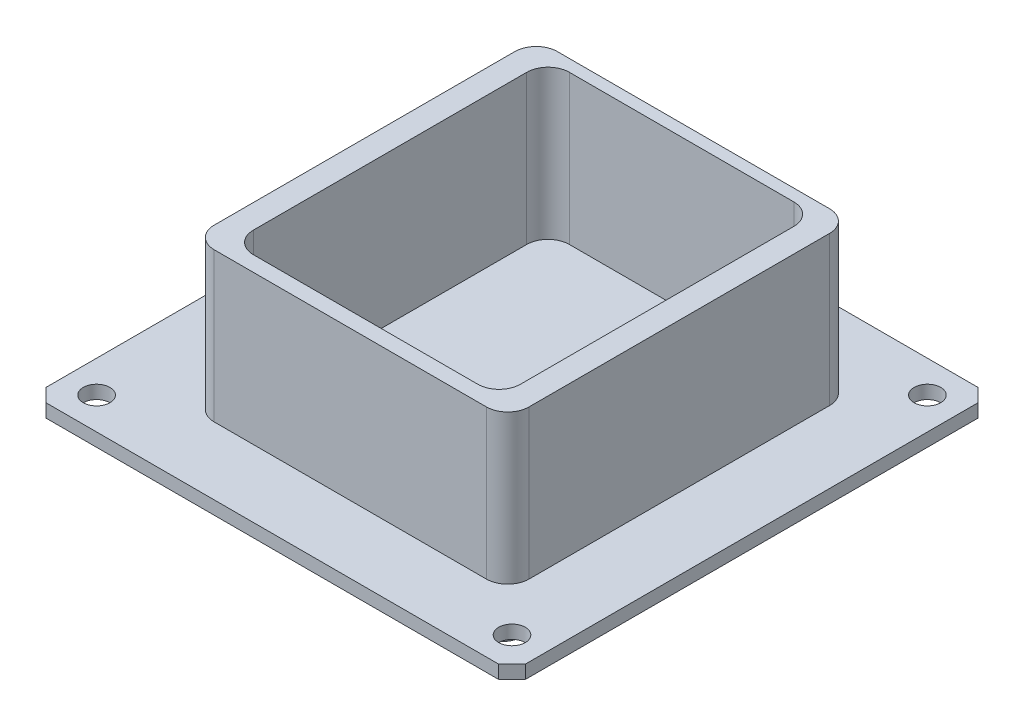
ISO-10303-21;
HEADER;
FILE_DESCRIPTION(('STEP AP214'),'2;1');
FILE_NAME('part.step','',(''),(''),'','','');
FILE_SCHEMA(('AUTOMOTIVE_DESIGN { 1 0 10303 214 1 1 1 1 }'));
ENDSEC;
DATA;
#1=APPLICATION_CONTEXT('core data for automotive mechanical design processes');
#2=APPLICATION_PROTOCOL_DEFINITION('international standard','automotive_design',2000,#1);
#3=PRODUCT_CONTEXT('',#1,'mechanical');
#4=PRODUCT('Part','Part','',(#3));
#5=PRODUCT_RELATED_PRODUCT_CATEGORY('part','',(#4));
#6=PRODUCT_DEFINITION_FORMATION('','',#4);
#7=PRODUCT_DEFINITION_CONTEXT('part definition',#1,'design');
#8=PRODUCT_DEFINITION('design','',#6,#7);
#9=PRODUCT_DEFINITION_SHAPE('','',#8);
#10=(LENGTH_UNIT() NAMED_UNIT(*) SI_UNIT(.MILLI.,.METRE.));
#11=(NAMED_UNIT(*) PLANE_ANGLE_UNIT() SI_UNIT($,.RADIAN.));
#12=(NAMED_UNIT(*) SI_UNIT($,.STERADIAN.) SOLID_ANGLE_UNIT());
#13=UNCERTAINTY_MEASURE_WITH_UNIT(LENGTH_MEASURE(1.E-05),#10,'distance_accuracy_value','');
#14=(GEOMETRIC_REPRESENTATION_CONTEXT(3) GLOBAL_UNCERTAINTY_ASSIGNED_CONTEXT((#13)) GLOBAL_UNIT_ASSIGNED_CONTEXT((#10,
#11,#12)) REPRESENTATION_CONTEXT('',''));
#15=CARTESIAN_POINT('',(0.,0.,0.));
#16=DIRECTION('',(0.,0.,1.));
#17=DIRECTION('',(1.,0.,0.));
#18=AXIS2_PLACEMENT_3D('',#15,#16,#17);
#19=CARTESIAN_POINT('',(84.1375,0.,-28.575));
#20=DIRECTION('',(0.,1.,0.));
#21=DIRECTION('',(0.,0.,1.));
#22=AXIS2_PLACEMENT_3D('',#19,#20,#21);
#23=PLANE('',#22);
#24=CARTESIAN_POINT('',(3.81,0.,-3.81));
#25=DIRECTION('',(0.,1.,0.));
#26=DIRECTION('',(0.,0.,-1.));
#27=AXIS2_PLACEMENT_3D('',#24,#25,#26);
#28=CIRCLE('',#27,1.5875);
#29=CARTESIAN_POINT('',(3.81,0.,-5.3975));
#30=VERTEX_POINT('',#29);
#31=EDGE_CURVE('E405',#30,#30,#28,.T.);
#32=ORIENTED_EDGE('',*,*,#31,.T.);
#33=EDGE_LOOP('',(#32));
#34=FACE_BOUND('',#33,.T.);
#35=CARTESIAN_POINT('',(53.34,0.,-53.34));
#36=DIRECTION('',(0.,1.,0.));
#37=DIRECTION('',(0.,0.,-1.));
#38=AXIS2_PLACEMENT_3D('',#35,#36,#37);
#39=CIRCLE('',#38,1.5875);
#40=CARTESIAN_POINT('',(53.34,0.,-54.9275));
#41=VERTEX_POINT('',#40);
#42=EDGE_CURVE('E422',#41,#41,#39,.T.);
#43=ORIENTED_EDGE('',*,*,#42,.T.);
#44=EDGE_LOOP('',(#43));
#45=FACE_BOUND('',#44,.T.);
#46=DIRECTION('',(-0.707106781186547,0.,-0.707106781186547));
#47=VECTOR('',#46,1.);
#48=CARTESIAN_POINT('',(55.5625,0.,-57.15));
#49=LINE('',#48,#47);
#50=CARTESIAN_POINT('',(57.15,0.,-55.5625));
#51=VERTEX_POINT('',#50);
#52=CARTESIAN_POINT('',(55.5625,0.,-57.15));
#53=VERTEX_POINT('',#52);
#54=EDGE_CURVE('E264',#51,#53,#49,.T.);
#55=ORIENTED_EDGE('',*,*,#54,.F.);
#56=DIRECTION('',(0.,0.,-1.));
#57=VECTOR('',#56,1.);
#58=CARTESIAN_POINT('',(57.15,0.,-1.5875));
#59=LINE('',#58,#57);
#60=CARTESIAN_POINT('',(57.15,0.,-1.5875));
#61=VERTEX_POINT('',#60);
#62=EDGE_CURVE('E260',#61,#51,#59,.T.);
#63=ORIENTED_EDGE('',*,*,#62,.F.);
#64=DIRECTION('',(0.707106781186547,0.,-0.707106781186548));
#65=VECTOR('',#64,1.);
#66=CARTESIAN_POINT('',(55.5625,0.,0.));
#67=LINE('',#66,#65);
#68=CARTESIAN_POINT('',(55.5625,0.,0.));
#69=VERTEX_POINT('',#68);
#70=EDGE_CURVE('E458',#69,#61,#67,.T.);
#71=ORIENTED_EDGE('',*,*,#70,.F.);
#72=DIRECTION('',(1.,0.,0.));
#73=VECTOR('',#72,1.);
#74=CARTESIAN_POINT('',(1.5875,0.,0.));
#75=LINE('',#74,#73);
#76=CARTESIAN_POINT('',(1.5875,0.,0.));
#77=VERTEX_POINT('',#76);
#78=EDGE_CURVE('E456',#77,#69,#75,.T.);
#79=ORIENTED_EDGE('',*,*,#78,.F.);
#80=DIRECTION('',(0.707106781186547,0.,0.707106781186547));
#81=VECTOR('',#80,1.);
#82=CARTESIAN_POINT('',(0.,0.,-1.5875));
#83=LINE('',#82,#81);
#84=CARTESIAN_POINT('',(0.,0.,-1.5875));
#85=VERTEX_POINT('',#84);
#86=EDGE_CURVE('E454',#85,#77,#83,.T.);
#87=ORIENTED_EDGE('',*,*,#86,.F.);
#88=DIRECTION('',(0.,0.,1.));
#89=VECTOR('',#88,1.);
#90=CARTESIAN_POINT('',(0.,0.,-1.5875));
#91=LINE('',#90,#89);
#92=CARTESIAN_POINT('',(0.,0.,-55.5625));
#93=VERTEX_POINT('',#92);
#94=EDGE_CURVE('E452',#93,#85,#91,.T.);
#95=ORIENTED_EDGE('',*,*,#94,.F.);
#96=DIRECTION('',(-0.707106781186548,0.,0.707106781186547));
#97=VECTOR('',#96,1.);
#98=CARTESIAN_POINT('',(0.,0.,-55.5625));
#99=LINE('',#98,#97);
#100=CARTESIAN_POINT('',(1.5875,0.,-57.15));
#101=VERTEX_POINT('',#100);
#102=EDGE_CURVE('E450',#101,#93,#99,.T.);
#103=ORIENTED_EDGE('',*,*,#102,.F.);
#104=DIRECTION('',(-1.,0.,0.));
#105=VECTOR('',#104,1.);
#106=CARTESIAN_POINT('',(1.5875,0.,-57.15));
#107=LINE('',#106,#105);
#108=EDGE_CURVE('E448',#53,#101,#107,.T.);
#109=ORIENTED_EDGE('',*,*,#108,.F.);
#110=EDGE_LOOP('',(#55,#63,#71,#79,#87,#95,#103,#109));
#111=FACE_BOUND('',#110,.T.);
#112=CARTESIAN_POINT('',(53.34,0.,-3.81));
#113=DIRECTION('',(0.,1.,0.));
#114=DIRECTION('',(0.,0.,1.));
#115=AXIS2_PLACEMENT_3D('',#112,#113,#114);
#116=CIRCLE('',#115,1.5875);
#117=CARTESIAN_POINT('',(53.34,0.,-2.2225));
#118=VERTEX_POINT('',#117);
#119=EDGE_CURVE('E428',#118,#118,#116,.T.);
#120=ORIENTED_EDGE('',*,*,#119,.T.);
#121=EDGE_LOOP('',(#120));
#122=FACE_BOUND('',#121,.T.);
#123=CARTESIAN_POINT('',(3.81,0.,-53.34));
#124=DIRECTION('',(0.,1.,0.));
#125=DIRECTION('',(0.,0.,1.));
#126=AXIS2_PLACEMENT_3D('',#123,#124,#125);
#127=CIRCLE('',#126,1.5875);
#128=CARTESIAN_POINT('',(3.81,0.,-51.7525));
#129=VERTEX_POINT('',#128);
#130=EDGE_CURVE('E416',#129,#129,#127,.T.);
#131=ORIENTED_EDGE('',*,*,#130,.T.);
#132=EDGE_LOOP('',(#131));
#133=FACE_BOUND('',#132,.T.);
#134=DIRECTION('',(0.,0.,-1.));
#135=VECTOR('',#134,1.);
#136=CARTESIAN_POINT('',(12.8335904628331,0.,-8.40284011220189));
#137=LINE('',#136,#135);
#138=CARTESIAN_POINT('',(12.8335904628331,0.,-10.9428401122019));
#139=VERTEX_POINT('',#138);
#140=CARTESIAN_POINT('',(12.8335904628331,0.,-47.8993057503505));
#141=VERTEX_POINT('',#140);
#142=EDGE_CURVE('E929',#139,#141,#137,.T.);
#143=ORIENTED_EDGE('',*,*,#142,.F.);
#144=CARTESIAN_POINT('',(15.3735904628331,0.,-10.9428401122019));
#145=DIRECTION('',(0.,1.,0.));
#146=DIRECTION('',(0.,0.,1.));
#147=AXIS2_PLACEMENT_3D('',#144,#145,#146);
#148=CIRCLE('',#147,2.54);
#149=CARTESIAN_POINT('',(15.3735904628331,0.,-8.40284011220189));
#150=VERTEX_POINT('',#149);
#151=EDGE_CURVE('E355',#139,#150,#148,.T.);
#152=ORIENTED_EDGE('',*,*,#151,.T.);
#153=DIRECTION('',(-1.,0.,0.));
#154=VECTOR('',#153,1.);
#155=CARTESIAN_POINT('',(12.8335904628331,0.,-8.40284011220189));
#156=LINE('',#155,#154);
#157=CARTESIAN_POINT('',(44.9380504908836,0.,-8.40284011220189));
#158=VERTEX_POINT('',#157);
#159=EDGE_CURVE('E919',#158,#150,#156,.T.);
#160=ORIENTED_EDGE('',*,*,#159,.F.);
#161=CARTESIAN_POINT('',(44.9380504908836,0.,-10.9428401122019));
#162=DIRECTION('',(0.,1.,0.));
#163=DIRECTION('',(0.,0.,1.));
#164=AXIS2_PLACEMENT_3D('',#161,#162,#163);
#165=CIRCLE('',#164,2.54);
#166=CARTESIAN_POINT('',(47.4780504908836,0.,-10.9428401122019));
#167=VERTEX_POINT('',#166);
#168=EDGE_CURVE('E359',#158,#167,#165,.T.);
#169=ORIENTED_EDGE('',*,*,#168,.T.);
#170=DIRECTION('',(0.,0.,1.));
#171=VECTOR('',#170,1.);
#172=CARTESIAN_POINT('',(47.4780504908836,0.,-8.40284011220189));
#173=LINE('',#172,#171);
#174=CARTESIAN_POINT('',(47.4780504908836,0.,-47.8993057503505));
#175=VERTEX_POINT('',#174);
#176=EDGE_CURVE('E923',#175,#167,#173,.T.);
#177=ORIENTED_EDGE('',*,*,#176,.F.);
#178=CARTESIAN_POINT('',(44.9380504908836,0.,-47.8993057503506));
#179=DIRECTION('',(0.,1.,0.));
#180=DIRECTION('',(0.,0.,1.));
#181=AXIS2_PLACEMENT_3D('',#178,#179,#180);
#182=CIRCLE('',#181,2.54);
#183=CARTESIAN_POINT('',(44.9380504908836,0.,-50.4393057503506));
#184=VERTEX_POINT('',#183);
#185=EDGE_CURVE('E357',#175,#184,#182,.T.);
#186=ORIENTED_EDGE('',*,*,#185,.T.);
#187=DIRECTION('',(1.,0.,0.));
#188=VECTOR('',#187,1.);
#189=CARTESIAN_POINT('',(12.8335904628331,0.,-50.4393057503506));
#190=LINE('',#189,#188);
#191=CARTESIAN_POINT('',(15.3735904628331,0.,-50.4393057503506));
#192=VERTEX_POINT('',#191);
#193=EDGE_CURVE('E926',#192,#184,#190,.T.);
#194=ORIENTED_EDGE('',*,*,#193,.F.);
#195=CARTESIAN_POINT('',(15.3735904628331,0.,-47.8993057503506));
#196=DIRECTION('',(0.,1.,0.));
#197=DIRECTION('',(0.,0.,1.));
#198=AXIS2_PLACEMENT_3D('',#195,#196,#197);
#199=CIRCLE('',#198,2.54);
#200=EDGE_CURVE('E353',#192,#141,#199,.T.);
#201=ORIENTED_EDGE('',*,*,#200,.T.);
#202=EDGE_LOOP('',(#143,#152,#160,#169,#177,#186,#194,#201));
#203=FACE_BOUND('',#202,.T.);
#204=ADVANCED_FACE('F30',(#34,#45,#111,#122,#133,#203),#23,.F.);
#205=CARTESIAN_POINT('',(84.1375,1.5875,-28.575));
#206=DIRECTION('',(0.,1.,0.));
#207=DIRECTION('',(0.,0.,1.));
#208=AXIS2_PLACEMENT_3D('',#205,#206,#207);
#209=PLANE('',#208);
#210=CARTESIAN_POINT('',(3.81,1.5875,-53.34));
#211=DIRECTION('',(0.,1.,0.));
#212=DIRECTION('',(0.,0.,1.));
#213=AXIS2_PLACEMENT_3D('',#210,#211,#212);
#214=CIRCLE('',#213,1.5875);
#215=CARTESIAN_POINT('',(3.81,1.5875,-51.7525));
#216=VERTEX_POINT('',#215);
#217=EDGE_CURVE('E419',#216,#216,#214,.T.);
#218=ORIENTED_EDGE('',*,*,#217,.F.);
#219=EDGE_LOOP('',(#218));
#220=FACE_BOUND('',#219,.T.);
#221=CARTESIAN_POINT('',(53.34,1.5875,-3.81));
#222=DIRECTION('',(0.,1.,0.));
#223=DIRECTION('',(0.,0.,1.));
#224=AXIS2_PLACEMENT_3D('',#221,#222,#223);
#225=CIRCLE('',#224,1.5875);
#226=CARTESIAN_POINT('',(53.34,1.5875,-2.2225));
#227=VERTEX_POINT('',#226);
#228=EDGE_CURVE('E431',#227,#227,#225,.T.);
#229=ORIENTED_EDGE('',*,*,#228,.F.);
#230=EDGE_LOOP('',(#229));
#231=FACE_BOUND('',#230,.T.);
#232=DIRECTION('',(-0.707106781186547,0.,-0.707106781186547));
#233=VECTOR('',#232,1.);
#234=CARTESIAN_POINT('',(55.5625,1.5875,-57.15));
#235=LINE('',#234,#233);
#236=CARTESIAN_POINT('',(57.15,1.5875,-55.5625));
#237=VERTEX_POINT('',#236);
#238=CARTESIAN_POINT('',(55.5625,1.5875,-57.15));
#239=VERTEX_POINT('',#238);
#240=EDGE_CURVE('E250',#237,#239,#235,.T.);
#241=ORIENTED_EDGE('',*,*,#240,.T.);
#242=DIRECTION('',(-1.,0.,0.));
#243=VECTOR('',#242,1.);
#244=CARTESIAN_POINT('',(1.5875,1.5875,-57.15));
#245=LINE('',#244,#243);
#246=CARTESIAN_POINT('',(1.5875,1.5875,-57.15));
#247=VERTEX_POINT('',#246);
#248=EDGE_CURVE('E239',#239,#247,#245,.T.);
#249=ORIENTED_EDGE('',*,*,#248,.T.);
#250=DIRECTION('',(-0.707106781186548,0.,0.707106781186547));
#251=VECTOR('',#250,1.);
#252=CARTESIAN_POINT('',(0.,1.5875,-55.5625));
#253=LINE('',#252,#251);
#254=CARTESIAN_POINT('',(0.,1.5875,-55.5625));
#255=VERTEX_POINT('',#254);
#256=EDGE_CURVE('E249',#247,#255,#253,.T.);
#257=ORIENTED_EDGE('',*,*,#256,.T.);
#258=DIRECTION('',(0.,0.,1.));
#259=VECTOR('',#258,1.);
#260=CARTESIAN_POINT('',(0.,1.5875,-1.5875));
#261=LINE('',#260,#259);
#262=CARTESIAN_POINT('',(0.,1.5875,-1.5875));
#263=VERTEX_POINT('',#262);
#264=EDGE_CURVE('E437',#255,#263,#261,.T.);
#265=ORIENTED_EDGE('',*,*,#264,.T.);
#266=DIRECTION('',(0.707106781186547,0.,0.707106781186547));
#267=VECTOR('',#266,1.);
#268=CARTESIAN_POINT('',(0.,1.5875,-1.5875));
#269=LINE('',#268,#267);
#270=CARTESIAN_POINT('',(1.5875,1.5875,0.));
#271=VERTEX_POINT('',#270);
#272=EDGE_CURVE('E439',#263,#271,#269,.T.);
#273=ORIENTED_EDGE('',*,*,#272,.T.);
#274=DIRECTION('',(1.,0.,0.));
#275=VECTOR('',#274,1.);
#276=CARTESIAN_POINT('',(1.5875,1.5875,0.));
#277=LINE('',#276,#275);
#278=CARTESIAN_POINT('',(55.5625,1.5875,0.));
#279=VERTEX_POINT('',#278);
#280=EDGE_CURVE('E441',#271,#279,#277,.T.);
#281=ORIENTED_EDGE('',*,*,#280,.T.);
#282=DIRECTION('',(0.707106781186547,0.,-0.707106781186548));
#283=VECTOR('',#282,1.);
#284=CARTESIAN_POINT('',(55.5625,1.5875,0.));
#285=LINE('',#284,#283);
#286=CARTESIAN_POINT('',(57.15,1.5875,-1.5875));
#287=VERTEX_POINT('',#286);
#288=EDGE_CURVE('E443',#279,#287,#285,.T.);
#289=ORIENTED_EDGE('',*,*,#288,.T.);
#290=DIRECTION('',(0.,0.,-1.));
#291=VECTOR('',#290,1.);
#292=CARTESIAN_POINT('',(57.15,1.5875,-1.5875));
#293=LINE('',#292,#291);
#294=EDGE_CURVE('E256',#287,#237,#293,.T.);
#295=ORIENTED_EDGE('',*,*,#294,.T.);
#296=EDGE_LOOP('',(#241,#249,#257,#265,#273,#281,#289,#295));
#297=FACE_BOUND('',#296,.T.);
#298=CARTESIAN_POINT('',(53.34,1.5875,-53.34));
#299=DIRECTION('',(0.,1.,0.));
#300=DIRECTION('',(0.,0.,-1.));
#301=AXIS2_PLACEMENT_3D('',#298,#299,#300);
#302=CIRCLE('',#301,1.5875);
#303=CARTESIAN_POINT('',(53.34,1.5875,-54.9275));
#304=VERTEX_POINT('',#303);
#305=EDGE_CURVE('E425',#304,#304,#302,.T.);
#306=ORIENTED_EDGE('',*,*,#305,.F.);
#307=EDGE_LOOP('',(#306));
#308=FACE_BOUND('',#307,.T.);
#309=CARTESIAN_POINT('',(3.81,1.5875,-3.81));
#310=DIRECTION('',(0.,1.,0.));
#311=DIRECTION('',(0.,0.,-1.));
#312=AXIS2_PLACEMENT_3D('',#309,#310,#311);
#313=CIRCLE('',#312,1.5875);
#314=CARTESIAN_POINT('',(3.81,1.5875,-5.3975));
#315=VERTEX_POINT('',#314);
#316=EDGE_CURVE('E413',#315,#315,#313,.T.);
#317=ORIENTED_EDGE('',*,*,#316,.F.);
#318=EDGE_LOOP('',(#317));
#319=FACE_BOUND('',#318,.T.);
#320=DIRECTION('',(1.,0.,0.));
#321=VECTOR('',#320,1.);
#322=CARTESIAN_POINT('',(11.0523842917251,1.5875,-8.04659887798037));
#323=LINE('',#322,#321);
#324=CARTESIAN_POINT('',(13.5923842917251,1.5875,-8.04659887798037));
#325=VERTEX_POINT('',#324);
#326=CARTESIAN_POINT('',(46.0513043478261,1.5875,-8.04659887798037));
#327=VERTEX_POINT('',#326);
#328=EDGE_CURVE('E374',#325,#327,#323,.T.);
#329=ORIENTED_EDGE('',*,*,#328,.F.);
#330=CARTESIAN_POINT('',(13.5923842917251,1.5875,-10.5865988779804));
#331=DIRECTION('',(0.,1.,0.));
#332=DIRECTION('',(0.,0.,1.));
#333=AXIS2_PLACEMENT_3D('',#330,#331,#332);
#334=CIRCLE('',#333,2.54);
#335=CARTESIAN_POINT('',(11.0523842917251,1.5875,-10.5865988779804));
#336=VERTEX_POINT('',#335);
#337=EDGE_CURVE('E38',#325,#336,#334,.F.);
#338=ORIENTED_EDGE('',*,*,#337,.T.);
#339=DIRECTION('',(0.,0.,1.));
#340=VECTOR('',#339,1.);
#341=CARTESIAN_POINT('',(11.0523842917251,1.5875,-48.9698106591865));
#342=LINE('',#341,#340);
#343=CARTESIAN_POINT('',(11.0523842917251,1.5875,-46.4298106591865));
#344=VERTEX_POINT('',#343);
#345=EDGE_CURVE('E373',#344,#336,#342,.T.);
#346=ORIENTED_EDGE('',*,*,#345,.F.);
#347=CARTESIAN_POINT('',(13.5923842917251,1.5875,-46.4298106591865));
#348=DIRECTION('',(0.,1.,0.));
#349=DIRECTION('',(0.,0.,1.));
#350=AXIS2_PLACEMENT_3D('',#347,#348,#349);
#351=CIRCLE('',#350,2.54);
#352=CARTESIAN_POINT('',(13.5923842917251,1.5875,-48.9698106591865));
#353=VERTEX_POINT('',#352);
#354=EDGE_CURVE('E369',#344,#353,#351,.F.);
#355=ORIENTED_EDGE('',*,*,#354,.T.);
#356=DIRECTION('',(-1.,0.,0.));
#357=VECTOR('',#356,1.);
#358=CARTESIAN_POINT('',(11.0523842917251,1.5875,-48.9698106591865));
#359=LINE('',#358,#357);
#360=CARTESIAN_POINT('',(46.0513043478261,1.5875,-48.9698106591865));
#361=VERTEX_POINT('',#360);
#362=EDGE_CURVE('E400',#361,#353,#359,.T.);
#363=ORIENTED_EDGE('',*,*,#362,.F.);
#364=CARTESIAN_POINT('',(46.0513043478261,1.5875,-46.4298106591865));
#365=DIRECTION('',(0.,1.,0.));
#366=DIRECTION('',(0.,0.,1.));
#367=AXIS2_PLACEMENT_3D('',#364,#365,#366);
#368=CIRCLE('',#367,2.54);
#369=CARTESIAN_POINT('',(48.5913043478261,1.5875,-46.4298106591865));
#370=VERTEX_POINT('',#369);
#371=EDGE_CURVE('E367',#361,#370,#368,.F.);
#372=ORIENTED_EDGE('',*,*,#371,.T.);
#373=DIRECTION('',(0.,0.,-1.));
#374=VECTOR('',#373,1.);
#375=CARTESIAN_POINT('',(48.5913043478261,1.5875,-48.9698106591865));
#376=LINE('',#375,#374);
#377=CARTESIAN_POINT('',(48.5913043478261,1.5875,-10.5865988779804));
#378=VERTEX_POINT('',#377);
#379=EDGE_CURVE('E408',#378,#370,#376,.T.);
#380=ORIENTED_EDGE('',*,*,#379,.F.);
#381=CARTESIAN_POINT('',(46.0513043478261,1.5875,-10.5865988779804));
#382=DIRECTION('',(0.,1.,0.));
#383=DIRECTION('',(0.,0.,1.));
#384=AXIS2_PLACEMENT_3D('',#381,#382,#383);
#385=CIRCLE('',#384,2.54);
#386=EDGE_CURVE('E45',#378,#327,#385,.F.);
#387=ORIENTED_EDGE('',*,*,#386,.T.);
#388=EDGE_LOOP('',(#329,#338,#346,#355,#363,#372,#380,#387));
#389=FACE_BOUND('',#388,.T.);
#390=ADVANCED_FACE('F253',(#220,#231,#297,#308,#319,#389),#209,.T.);
#391=CARTESIAN_POINT('',(55.5625,1.5875,-57.15));
#392=DIRECTION('',(-0.707106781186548,0.,0.707106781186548));
#393=DIRECTION('',(0.707106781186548,0.,0.707106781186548));
#394=AXIS2_PLACEMENT_3D('',#391,#392,#393);
#395=PLANE('',#394);
#396=ORIENTED_EDGE('',*,*,#54,.T.);
#397=DIRECTION('',(0.,-1.,0.));
#398=VECTOR('',#397,1.);
#399=CARTESIAN_POINT('',(55.5625,1.5875,-57.15));
#400=LINE('',#399,#398);
#401=EDGE_CURVE('E243',#239,#53,#400,.T.);
#402=ORIENTED_EDGE('',*,*,#401,.F.);
#403=ORIENTED_EDGE('',*,*,#240,.F.);
#404=DIRECTION('',(0.,-1.,0.));
#405=VECTOR('',#404,1.);
#406=CARTESIAN_POINT('',(57.15,1.5875,-55.5625));
#407=LINE('',#406,#405);
#408=EDGE_CURVE('E446',#237,#51,#407,.T.);
#409=ORIENTED_EDGE('',*,*,#408,.T.);
#410=EDGE_LOOP('',(#396,#402,#403,#409));
#411=FACE_BOUND('',#410,.T.);
#412=ADVANCED_FACE('F262',(#411),#395,.F.);
#413=CARTESIAN_POINT('',(1.5875,1.5875,-57.15));
#414=DIRECTION('',(0.,0.,1.));
#415=DIRECTION('',(1.,0.,0.));
#416=AXIS2_PLACEMENT_3D('',#413,#414,#415);
#417=PLANE('',#416);
#418=ORIENTED_EDGE('',*,*,#108,.T.);
#419=DIRECTION('',(0.,-1.,0.));
#420=VECTOR('',#419,1.);
#421=CARTESIAN_POINT('',(1.5875,1.5875,-57.15));
#422=LINE('',#421,#420);
#423=EDGE_CURVE('E246',#247,#101,#422,.T.);
#424=ORIENTED_EDGE('',*,*,#423,.F.);
#425=ORIENTED_EDGE('',*,*,#248,.F.);
#426=ORIENTED_EDGE('',*,*,#401,.T.);
#427=EDGE_LOOP('',(#418,#424,#425,#426));
#428=FACE_BOUND('',#427,.T.);
#429=ADVANCED_FACE('F241',(#428),#417,.F.);
#430=CARTESIAN_POINT('',(0.,1.5875,-55.5625));
#431=DIRECTION('',(0.707106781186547,0.,0.707106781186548));
#432=DIRECTION('',(0.707106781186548,0.,-0.707106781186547));
#433=AXIS2_PLACEMENT_3D('',#430,#431,#432);
#434=PLANE('',#433);
#435=ORIENTED_EDGE('',*,*,#102,.T.);
#436=DIRECTION('',(0.,-1.,0.));
#437=VECTOR('',#436,1.);
#438=CARTESIAN_POINT('',(0.,1.5875,-55.5625));
#439=LINE('',#438,#437);
#440=EDGE_CURVE('E269',#255,#93,#439,.T.);
#441=ORIENTED_EDGE('',*,*,#440,.F.);
#442=ORIENTED_EDGE('',*,*,#256,.F.);
#443=ORIENTED_EDGE('',*,*,#423,.T.);
#444=EDGE_LOOP('',(#435,#441,#442,#443));
#445=FACE_BOUND('',#444,.T.);
#446=ADVANCED_FACE('F497',(#445),#434,.F.);
#447=CARTESIAN_POINT('',(0.,1.5875,-1.5875));
#448=DIRECTION('',(1.,0.,0.));
#449=DIRECTION('',(0.,0.,-1.));
#450=AXIS2_PLACEMENT_3D('',#447,#448,#449);
#451=PLANE('',#450);
#452=ORIENTED_EDGE('',*,*,#94,.T.);
#453=DIRECTION('',(0.,-1.,0.));
#454=VECTOR('',#453,1.);
#455=CARTESIAN_POINT('',(0.,1.5875,-1.5875));
#456=LINE('',#455,#454);
#457=EDGE_CURVE('E471',#263,#85,#456,.T.);
#458=ORIENTED_EDGE('',*,*,#457,.F.);
#459=ORIENTED_EDGE('',*,*,#264,.F.);
#460=ORIENTED_EDGE('',*,*,#440,.T.);
#461=EDGE_LOOP('',(#452,#458,#459,#460));
#462=FACE_BOUND('',#461,.T.);
#463=ADVANCED_FACE('F478',(#462),#451,.F.);
#464=CARTESIAN_POINT('',(0.,1.5875,-1.5875));
#465=DIRECTION('',(0.707106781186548,0.,-0.707106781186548));
#466=DIRECTION('',(-0.707106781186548,0.,-0.707106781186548));
#467=AXIS2_PLACEMENT_3D('',#464,#465,#466);
#468=PLANE('',#467);
#469=ORIENTED_EDGE('',*,*,#86,.T.);
#470=DIRECTION('',(0.,-1.,0.));
#471=VECTOR('',#470,1.);
#472=CARTESIAN_POINT('',(1.5875,1.5875,0.));
#473=LINE('',#472,#471);
#474=EDGE_CURVE('E468',#271,#77,#473,.T.);
#475=ORIENTED_EDGE('',*,*,#474,.F.);
#476=ORIENTED_EDGE('',*,*,#272,.F.);
#477=ORIENTED_EDGE('',*,*,#457,.T.);
#478=EDGE_LOOP('',(#469,#475,#476,#477));
#479=FACE_BOUND('',#478,.T.);
#480=ADVANCED_FACE('F489',(#479),#468,.F.);
#481=CARTESIAN_POINT('',(1.5875,1.5875,0.));
#482=DIRECTION('',(0.,0.,-1.));
#483=DIRECTION('',(-1.,0.,0.));
#484=AXIS2_PLACEMENT_3D('',#481,#482,#483);
#485=PLANE('',#484);
#486=ORIENTED_EDGE('',*,*,#78,.T.);
#487=DIRECTION('',(0.,-1.,0.));
#488=VECTOR('',#487,1.);
#489=CARTESIAN_POINT('',(55.5625,1.5875,0.));
#490=LINE('',#489,#488);
#491=EDGE_CURVE('E465',#279,#69,#490,.T.);
#492=ORIENTED_EDGE('',*,*,#491,.F.);
#493=ORIENTED_EDGE('',*,*,#280,.F.);
#494=ORIENTED_EDGE('',*,*,#474,.T.);
#495=EDGE_LOOP('',(#486,#492,#493,#494));
#496=FACE_BOUND('',#495,.T.);
#497=ADVANCED_FACE('F493',(#496),#485,.F.);
#498=CARTESIAN_POINT('',(55.5625,1.5875,0.));
#499=DIRECTION('',(-0.707106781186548,0.,-0.707106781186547));
#500=DIRECTION('',(-0.707106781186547,0.,0.707106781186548));
#501=AXIS2_PLACEMENT_3D('',#498,#499,#500);
#502=PLANE('',#501);
#503=ORIENTED_EDGE('',*,*,#70,.T.);
#504=DIRECTION('',(0.,-1.,0.));
#505=VECTOR('',#504,1.);
#506=CARTESIAN_POINT('',(57.15,1.5875,-1.5875));
#507=LINE('',#506,#505);
#508=EDGE_CURVE('E462',#287,#61,#507,.T.);
#509=ORIENTED_EDGE('',*,*,#508,.F.);
#510=ORIENTED_EDGE('',*,*,#288,.F.);
#511=ORIENTED_EDGE('',*,*,#491,.T.);
#512=EDGE_LOOP('',(#503,#509,#510,#511));
#513=FACE_BOUND('',#512,.T.);
#514=ADVANCED_FACE('F522',(#513),#502,.F.);
#515=CARTESIAN_POINT('',(57.15,1.5875,-1.5875));
#516=DIRECTION('',(-1.,0.,0.));
#517=DIRECTION('',(0.,0.,1.));
#518=AXIS2_PLACEMENT_3D('',#515,#516,#517);
#519=PLANE('',#518);
#520=ORIENTED_EDGE('',*,*,#62,.T.);
#521=ORIENTED_EDGE('',*,*,#408,.F.);
#522=ORIENTED_EDGE('',*,*,#294,.F.);
#523=ORIENTED_EDGE('',*,*,#508,.T.);
#524=EDGE_LOOP('',(#520,#521,#522,#523));
#525=FACE_BOUND('',#524,.T.);
#526=ADVANCED_FACE('F518',(#525),#519,.F.);
#527=CARTESIAN_POINT('',(53.34,1.5875,-3.81));
#528=DIRECTION('',(0.,-1.,0.));
#529=DIRECTION('',(0.,0.,-1.));
#530=AXIS2_PLACEMENT_3D('',#527,#528,#529);
#531=CYLINDRICAL_SURFACE('',#530,1.5875);
#532=ORIENTED_EDGE('',*,*,#228,.T.);
#533=EDGE_LOOP('',(#532));
#534=FACE_BOUND('',#533,.T.);
#535=ORIENTED_EDGE('',*,*,#119,.F.);
#536=EDGE_LOOP('',(#535));
#537=FACE_BOUND('',#536,.T.);
#538=ADVANCED_FACE('F521',(#534,#537),#531,.F.);
#539=CARTESIAN_POINT('',(53.34,1.5875,-53.34));
#540=DIRECTION('',(0.,-1.,0.));
#541=DIRECTION('',(0.,0.,-1.));
#542=AXIS2_PLACEMENT_3D('',#539,#540,#541);
#543=CYLINDRICAL_SURFACE('',#542,1.5875);
#544=ORIENTED_EDGE('',*,*,#305,.T.);
#545=EDGE_LOOP('',(#544));
#546=FACE_BOUND('',#545,.T.);
#547=ORIENTED_EDGE('',*,*,#42,.F.);
#548=EDGE_LOOP('',(#547));
#549=FACE_BOUND('',#548,.T.);
#550=ADVANCED_FACE('F552',(#546,#549),#543,.F.);
#551=CARTESIAN_POINT('',(3.81,1.5875,-53.34));
#552=DIRECTION('',(0.,-1.,0.));
#553=DIRECTION('',(0.,0.,-1.));
#554=AXIS2_PLACEMENT_3D('',#551,#552,#553);
#555=CYLINDRICAL_SURFACE('',#554,1.5875);
#556=ORIENTED_EDGE('',*,*,#217,.T.);
#557=EDGE_LOOP('',(#556));
#558=FACE_BOUND('',#557,.T.);
#559=ORIENTED_EDGE('',*,*,#130,.F.);
#560=EDGE_LOOP('',(#559));
#561=FACE_BOUND('',#560,.T.);
#562=ADVANCED_FACE('F559',(#558,#561),#555,.F.);
#563=CARTESIAN_POINT('',(3.81,1.5875,-3.81));
#564=DIRECTION('',(0.,-1.,0.));
#565=DIRECTION('',(0.,0.,-1.));
#566=AXIS2_PLACEMENT_3D('',#563,#564,#565);
#567=CYLINDRICAL_SURFACE('',#566,1.5875);
#568=ORIENTED_EDGE('',*,*,#316,.T.);
#569=EDGE_LOOP('',(#568));
#570=FACE_BOUND('',#569,.T.);
#571=ORIENTED_EDGE('',*,*,#31,.F.);
#572=EDGE_LOOP('',(#571));
#573=FACE_BOUND('',#572,.T.);
#574=ADVANCED_FACE('F567',(#570,#573),#567,.F.);
#575=CARTESIAN_POINT('',(11.0523842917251,19.3675,-8.04659887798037));
#576=DIRECTION('',(0.,1.,0.));
#577=DIRECTION('',(0.,0.,1.));
#578=AXIS2_PLACEMENT_3D('',#575,#576,#577);
#579=PLANE('',#578);
#580=DIRECTION('',(0.,0.,-1.));
#581=VECTOR('',#580,1.);
#582=CARTESIAN_POINT('',(48.5913043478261,19.3675,-48.9698106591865));
#583=LINE('',#582,#581);
#584=CARTESIAN_POINT('',(48.5913043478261,19.3675,-10.5865988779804));
#585=VERTEX_POINT('',#584);
#586=CARTESIAN_POINT('',(48.5913043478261,19.3675,-46.4298106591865));
#587=VERTEX_POINT('',#586);
#588=EDGE_CURVE('E396',#585,#587,#583,.T.);
#589=ORIENTED_EDGE('',*,*,#588,.T.);
#590=CARTESIAN_POINT('',(46.0513043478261,19.3675,-46.4298106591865));
#591=DIRECTION('',(0.,1.,0.));
#592=DIRECTION('',(0.,0.,1.));
#593=AXIS2_PLACEMENT_3D('',#590,#591,#592);
#594=CIRCLE('',#593,2.54);
#595=CARTESIAN_POINT('',(46.0513043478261,19.3675,-48.9698106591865));
#596=VERTEX_POINT('',#595);
#597=EDGE_CURVE('E342',#587,#596,#594,.T.);
#598=ORIENTED_EDGE('',*,*,#597,.T.);
#599=DIRECTION('',(-1.,0.,0.));
#600=VECTOR('',#599,1.);
#601=CARTESIAN_POINT('',(11.0523842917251,19.3675,-48.9698106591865));
#602=LINE('',#601,#600);
#603=CARTESIAN_POINT('',(13.5923842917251,19.3675,-48.9698106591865));
#604=VERTEX_POINT('',#603);
#605=EDGE_CURVE('E398',#596,#604,#602,.T.);
#606=ORIENTED_EDGE('',*,*,#605,.T.);
#607=CARTESIAN_POINT('',(13.5923842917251,19.3675,-46.4298106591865));
#608=DIRECTION('',(0.,1.,0.));
#609=DIRECTION('',(0.,0.,1.));
#610=AXIS2_PLACEMENT_3D('',#607,#608,#609);
#611=CIRCLE('',#610,2.54);
#612=CARTESIAN_POINT('',(11.0523842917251,19.3675,-46.4298106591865));
#613=VERTEX_POINT('',#612);
#614=EDGE_CURVE('E340',#604,#613,#611,.T.);
#615=ORIENTED_EDGE('',*,*,#614,.T.);
#616=DIRECTION('',(0.,0.,1.));
#617=VECTOR('',#616,1.);
#618=CARTESIAN_POINT('',(11.0523842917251,19.3675,-48.9698106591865));
#619=LINE('',#618,#617);
#620=CARTESIAN_POINT('',(11.0523842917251,19.3675,-10.5865988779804));
#621=VERTEX_POINT('',#620);
#622=EDGE_CURVE('E392',#613,#621,#619,.T.);
#623=ORIENTED_EDGE('',*,*,#622,.T.);
#624=CARTESIAN_POINT('',(13.5923842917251,19.3675,-10.5865988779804));
#625=DIRECTION('',(0.,1.,0.));
#626=DIRECTION('',(0.,0.,1.));
#627=AXIS2_PLACEMENT_3D('',#624,#625,#626);
#628=CIRCLE('',#627,2.54);
#629=CARTESIAN_POINT('',(13.5923842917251,19.3675,-8.04659887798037));
#630=VERTEX_POINT('',#629);
#631=EDGE_CURVE('E336',#621,#630,#628,.T.);
#632=ORIENTED_EDGE('',*,*,#631,.T.);
#633=DIRECTION('',(1.,0.,0.));
#634=VECTOR('',#633,1.);
#635=CARTESIAN_POINT('',(11.0523842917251,19.3675,-8.04659887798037));
#636=LINE('',#635,#634);
#637=CARTESIAN_POINT('',(46.0513043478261,19.3675,-8.04659887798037));
#638=VERTEX_POINT('',#637);
#639=EDGE_CURVE('E390',#630,#638,#636,.T.);
#640=ORIENTED_EDGE('',*,*,#639,.T.);
#641=CARTESIAN_POINT('',(46.0513043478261,19.3675,-10.5865988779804));
#642=DIRECTION('',(0.,1.,0.));
#643=DIRECTION('',(0.,0.,1.));
#644=AXIS2_PLACEMENT_3D('',#641,#642,#643);
#645=CIRCLE('',#644,2.54);
#646=EDGE_CURVE('E338',#638,#585,#645,.T.);
#647=ORIENTED_EDGE('',*,*,#646,.T.);
#648=EDGE_LOOP('',(#589,#598,#606,#615,#623,#632,#640,#647));
#649=FACE_BOUND('',#648,.T.);
#650=DIRECTION('',(1.,0.,0.));
#651=VECTOR('',#650,1.);
#652=CARTESIAN_POINT('',(13.9023141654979,19.3675,-9.87233520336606));
#653=LINE('',#652,#651);
#654=CARTESIAN_POINT('',(16.4423141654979,19.3675,-9.87233520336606));
#655=VERTEX_POINT('',#654);
#656=CARTESIAN_POINT('',(43.2013744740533,19.3675,-9.87233520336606));
#657=VERTEX_POINT('',#656);
#658=EDGE_CURVE('E896',#655,#657,#653,.T.);
#659=ORIENTED_EDGE('',*,*,#658,.F.);
#660=CARTESIAN_POINT('',(16.4423141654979,19.3675,-12.4123352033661));
#661=DIRECTION('',(0.,1.,0.));
#662=DIRECTION('',(0.,0.,1.));
#663=AXIS2_PLACEMENT_3D('',#660,#661,#662);
#664=CIRCLE('',#663,2.54);
#665=CARTESIAN_POINT('',(13.9023141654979,19.3675,-12.4123352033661));
#666=VERTEX_POINT('',#665);
#667=EDGE_CURVE('E361',#655,#666,#664,.F.);
#668=ORIENTED_EDGE('',*,*,#667,.T.);
#669=DIRECTION('',(0.,0.,1.));
#670=VECTOR('',#669,1.);
#671=CARTESIAN_POINT('',(13.9023141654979,19.3675,-47.5448457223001));
#672=LINE('',#671,#670);
#673=CARTESIAN_POINT('',(13.9023141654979,19.3675,-45.0048457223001));
#674=VERTEX_POINT('',#673);
#675=EDGE_CURVE('E900',#674,#666,#672,.T.);
#676=ORIENTED_EDGE('',*,*,#675,.F.);
#677=CARTESIAN_POINT('',(16.4423141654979,19.3675,-45.0048457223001));
#678=DIRECTION('',(0.,1.,0.));
#679=DIRECTION('',(0.,0.,1.));
#680=AXIS2_PLACEMENT_3D('',#677,#678,#679);
#681=CIRCLE('',#680,2.54);
#682=CARTESIAN_POINT('',(16.4423141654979,19.3675,-47.5448457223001));
#683=VERTEX_POINT('',#682);
#684=EDGE_CURVE('E365',#674,#683,#681,.F.);
#685=ORIENTED_EDGE('',*,*,#684,.T.);
#686=DIRECTION('',(-1.,0.,0.));
#687=VECTOR('',#686,1.);
#688=CARTESIAN_POINT('',(13.9023141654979,19.3675,-47.5448457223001));
#689=LINE('',#688,#687);
#690=CARTESIAN_POINT('',(43.2013744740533,19.3675,-47.5448457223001));
#691=VERTEX_POINT('',#690);
#692=EDGE_CURVE('E380',#691,#683,#689,.T.);
#693=ORIENTED_EDGE('',*,*,#692,.F.);
#694=CARTESIAN_POINT('',(43.2013744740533,19.3675,-45.0048457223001));
#695=DIRECTION('',(0.,1.,0.));
#696=DIRECTION('',(0.,0.,1.));
#697=AXIS2_PLACEMENT_3D('',#694,#695,#696);
#698=CIRCLE('',#697,2.54);
#699=CARTESIAN_POINT('',(45.7413744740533,19.3675,-45.0048457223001));
#700=VERTEX_POINT('',#699);
#701=EDGE_CURVE('E11',#691,#700,#698,.F.);
#702=ORIENTED_EDGE('',*,*,#701,.T.);
#703=DIRECTION('',(0.,0.,-1.));
#704=VECTOR('',#703,1.);
#705=CARTESIAN_POINT('',(45.7413744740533,19.3675,-47.5448457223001));
#706=LINE('',#705,#704);
#707=CARTESIAN_POINT('',(45.7413744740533,19.3675,-12.4123352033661));
#708=VERTEX_POINT('',#707);
#709=EDGE_CURVE('E890',#708,#700,#706,.T.);
#710=ORIENTED_EDGE('',*,*,#709,.F.);
#711=CARTESIAN_POINT('',(43.2013744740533,19.3675,-12.4123352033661));
#712=DIRECTION('',(0.,1.,0.));
#713=DIRECTION('',(0.,0.,1.));
#714=AXIS2_PLACEMENT_3D('',#711,#712,#713);
#715=CIRCLE('',#714,2.54);
#716=EDGE_CURVE('E363',#708,#657,#715,.F.);
#717=ORIENTED_EDGE('',*,*,#716,.T.);
#718=EDGE_LOOP('',(#659,#668,#676,#685,#693,#702,#710,#717));
#719=FACE_BOUND('',#718,.T.);
#720=ADVANCED_FACE('F388',(#649,#719),#579,.T.);
#721=CARTESIAN_POINT('',(11.0523842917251,19.3675,-48.9698106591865));
#722=DIRECTION('',(1.,0.,0.));
#723=DIRECTION('',(0.,0.,-1.));
#724=AXIS2_PLACEMENT_3D('',#721,#722,#723);
#725=PLANE('',#724);
#726=ORIENTED_EDGE('',*,*,#622,.F.);
#727=DIRECTION('',(0.,-1.,0.));
#728=VECTOR('',#727,1.);
#729=CARTESIAN_POINT('',(11.0523842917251,19.3675,-46.4298106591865));
#730=LINE('',#729,#728);
#731=EDGE_CURVE('E346',#613,#344,#730,.T.);
#732=ORIENTED_EDGE('',*,*,#731,.T.);
#733=ORIENTED_EDGE('',*,*,#345,.T.);
#734=DIRECTION('',(0.,-1.,0.));
#735=VECTOR('',#734,1.);
#736=CARTESIAN_POINT('',(11.0523842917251,19.3675,-10.5865988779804));
#737=LINE('',#736,#735);
#738=EDGE_CURVE('E344',#336,#621,#737,.F.);
#739=ORIENTED_EDGE('',*,*,#738,.T.);
#740=EDGE_LOOP('',(#726,#732,#733,#739));
#741=FACE_BOUND('',#740,.T.);
#742=ADVANCED_FACE('F377',(#741),#725,.F.);
#743=CARTESIAN_POINT('',(11.0523842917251,19.3675,-8.04659887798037));
#744=DIRECTION('',(0.,0.,-1.));
#745=DIRECTION('',(-1.,0.,0.));
#746=AXIS2_PLACEMENT_3D('',#743,#744,#745);
#747=PLANE('',#746);
#748=ORIENTED_EDGE('',*,*,#328,.T.);
#749=DIRECTION('',(0.,-1.,0.));
#750=VECTOR('',#749,1.);
#751=CARTESIAN_POINT('',(46.0513043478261,19.3675,-8.04659887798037));
#752=LINE('',#751,#750);
#753=EDGE_CURVE('E351',#327,#638,#752,.F.);
#754=ORIENTED_EDGE('',*,*,#753,.T.);
#755=ORIENTED_EDGE('',*,*,#639,.F.);
#756=DIRECTION('',(0.,-1.,0.));
#757=VECTOR('',#756,1.);
#758=CARTESIAN_POINT('',(13.5923842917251,19.3675,-8.04659887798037));
#759=LINE('',#758,#757);
#760=EDGE_CURVE('E349',#630,#325,#759,.T.);
#761=ORIENTED_EDGE('',*,*,#760,.T.);
#762=EDGE_LOOP('',(#748,#754,#755,#761));
#763=FACE_BOUND('',#762,.T.);
#764=ADVANCED_FACE('F394',(#763),#747,.F.);
#765=CARTESIAN_POINT('',(48.5913043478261,19.3675,-48.9698106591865));
#766=DIRECTION('',(-1.,0.,0.));
#767=DIRECTION('',(0.,0.,1.));
#768=AXIS2_PLACEMENT_3D('',#765,#766,#767);
#769=PLANE('',#768);
#770=ORIENTED_EDGE('',*,*,#379,.T.);
#771=DIRECTION('',(0.,-1.,0.));
#772=VECTOR('',#771,1.);
#773=CARTESIAN_POINT('',(48.5913043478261,19.3675,-46.4298106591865));
#774=LINE('',#773,#772);
#775=EDGE_CURVE('E334',#370,#587,#774,.F.);
#776=ORIENTED_EDGE('',*,*,#775,.T.);
#777=ORIENTED_EDGE('',*,*,#588,.F.);
#778=DIRECTION('',(0.,-1.,0.));
#779=VECTOR('',#778,1.);
#780=CARTESIAN_POINT('',(48.5913043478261,19.3675,-10.5865988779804));
#781=LINE('',#780,#779);
#782=EDGE_CURVE('E331',#585,#378,#781,.T.);
#783=ORIENTED_EDGE('',*,*,#782,.T.);
#784=EDGE_LOOP('',(#770,#776,#777,#783));
#785=FACE_BOUND('',#784,.T.);
#786=ADVANCED_FACE('F595',(#785),#769,.F.);
#787=CARTESIAN_POINT('',(11.0523842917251,19.3675,-48.9698106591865));
#788=DIRECTION('',(0.,0.,1.));
#789=DIRECTION('',(1.,0.,0.));
#790=AXIS2_PLACEMENT_3D('',#787,#788,#789);
#791=PLANE('',#790);
#792=ORIENTED_EDGE('',*,*,#605,.F.);
#793=DIRECTION('',(0.,-1.,0.));
#794=VECTOR('',#793,1.);
#795=CARTESIAN_POINT('',(46.0513043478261,19.3675,-48.9698106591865));
#796=LINE('',#795,#794);
#797=EDGE_CURVE('E328',#596,#361,#796,.T.);
#798=ORIENTED_EDGE('',*,*,#797,.T.);
#799=ORIENTED_EDGE('',*,*,#362,.T.);
#800=DIRECTION('',(0.,-1.,0.));
#801=VECTOR('',#800,1.);
#802=CARTESIAN_POINT('',(13.5923842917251,19.3675,-48.9698106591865));
#803=LINE('',#802,#801);
#804=EDGE_CURVE('E326',#353,#604,#803,.F.);
#805=ORIENTED_EDGE('',*,*,#804,.T.);
#806=EDGE_LOOP('',(#792,#798,#799,#805));
#807=FACE_BOUND('',#806,.T.);
#808=ADVANCED_FACE('F602',(#807),#791,.F.);
#809=CARTESIAN_POINT('',(13.9023141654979,19.3675,-47.5448457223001));
#810=DIRECTION('',(1.,0.,0.));
#811=DIRECTION('',(0.,0.,-1.));
#812=AXIS2_PLACEMENT_3D('',#809,#810,#811);
#813=PLANE('',#812);
#814=ORIENTED_EDGE('',*,*,#675,.T.);
#815=DIRECTION('',(0.,-1.,0.));
#816=VECTOR('',#815,1.);
#817=CARTESIAN_POINT('',(13.9023141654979,1.5875,-12.4123352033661));
#818=LINE('',#817,#816);
#819=CARTESIAN_POINT('',(13.9023141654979,1.5875,-12.4123352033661));
#820=VERTEX_POINT('',#819);
#821=EDGE_CURVE('E300',#666,#820,#818,.T.);
#822=ORIENTED_EDGE('',*,*,#821,.T.);
#823=DIRECTION('',(0.,0.,1.));
#824=VECTOR('',#823,1.);
#825=CARTESIAN_POINT('',(13.9023141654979,1.5875,-47.5448457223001));
#826=LINE('',#825,#824);
#827=CARTESIAN_POINT('',(13.9023141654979,1.5875,-45.0048457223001));
#828=VERTEX_POINT('',#827);
#829=EDGE_CURVE('E904',#828,#820,#826,.T.);
#830=ORIENTED_EDGE('',*,*,#829,.F.);
#831=DIRECTION('',(0.,-1.,0.));
#832=VECTOR('',#831,1.);
#833=CARTESIAN_POINT('',(13.9023141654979,19.3675,-45.0048457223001));
#834=LINE('',#833,#832);
#835=EDGE_CURVE('E298',#828,#674,#834,.F.);
#836=ORIENTED_EDGE('',*,*,#835,.T.);
#837=EDGE_LOOP('',(#814,#822,#830,#836));
#838=FACE_BOUND('',#837,.T.);
#839=ADVANCED_FACE('F610',(#838),#813,.T.);
#840=CARTESIAN_POINT('',(13.9023141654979,19.3675,-9.87233520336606));
#841=DIRECTION('',(0.,0.,-1.));
#842=DIRECTION('',(-1.,0.,0.));
#843=AXIS2_PLACEMENT_3D('',#840,#841,#842);
#844=PLANE('',#843);
#845=DIRECTION('',(1.,0.,0.));
#846=VECTOR('',#845,1.);
#847=CARTESIAN_POINT('',(13.9023141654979,1.5875,-9.87233520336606));
#848=LINE('',#847,#846);
#849=CARTESIAN_POINT('',(16.4423141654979,1.5875,-9.87233520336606));
#850=VERTEX_POINT('',#849);
#851=CARTESIAN_POINT('',(43.2013744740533,1.5875,-9.87233520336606));
#852=VERTEX_POINT('',#851);
#853=EDGE_CURVE('E907',#850,#852,#848,.T.);
#854=ORIENTED_EDGE('',*,*,#853,.F.);
#855=DIRECTION('',(0.,-1.,0.));
#856=VECTOR('',#855,1.);
#857=CARTESIAN_POINT('',(16.4423141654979,19.3675,-9.87233520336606));
#858=LINE('',#857,#856);
#859=EDGE_CURVE('E314',#850,#655,#858,.F.);
#860=ORIENTED_EDGE('',*,*,#859,.T.);
#861=ORIENTED_EDGE('',*,*,#658,.T.);
#862=DIRECTION('',(0.,-1.,0.));
#863=VECTOR('',#862,1.);
#864=CARTESIAN_POINT('',(43.2013744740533,1.5875,-9.87233520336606));
#865=LINE('',#864,#863);
#866=EDGE_CURVE('E311',#657,#852,#865,.T.);
#867=ORIENTED_EDGE('',*,*,#866,.T.);
#868=EDGE_LOOP('',(#854,#860,#861,#867));
#869=FACE_BOUND('',#868,.T.);
#870=ADVANCED_FACE('F618',(#869),#844,.T.);
#871=CARTESIAN_POINT('',(45.7413744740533,19.3675,-47.5448457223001));
#872=DIRECTION('',(-1.,0.,0.));
#873=DIRECTION('',(0.,0.,1.));
#874=AXIS2_PLACEMENT_3D('',#871,#872,#873);
#875=PLANE('',#874);
#876=DIRECTION('',(0.,0.,-1.));
#877=VECTOR('',#876,1.);
#878=CARTESIAN_POINT('',(45.7413744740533,1.5875,-47.5448457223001));
#879=LINE('',#878,#877);
#880=CARTESIAN_POINT('',(45.7413744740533,1.5875,-12.4123352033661));
#881=VERTEX_POINT('',#880);
#882=CARTESIAN_POINT('',(45.7413744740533,1.5875,-45.0048457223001));
#883=VERTEX_POINT('',#882);
#884=EDGE_CURVE('E911',#881,#883,#879,.T.);
#885=ORIENTED_EDGE('',*,*,#884,.F.);
#886=DIRECTION('',(0.,-1.,0.));
#887=VECTOR('',#886,1.);
#888=CARTESIAN_POINT('',(45.7413744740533,19.3675,-12.4123352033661));
#889=LINE('',#888,#887);
#890=EDGE_CURVE('E319',#881,#708,#889,.F.);
#891=ORIENTED_EDGE('',*,*,#890,.T.);
#892=ORIENTED_EDGE('',*,*,#709,.T.);
#893=DIRECTION('',(0.,-1.,0.));
#894=VECTOR('',#893,1.);
#895=CARTESIAN_POINT('',(45.7413744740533,1.5875,-45.0048457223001));
#896=LINE('',#895,#894);
#897=EDGE_CURVE('E316',#700,#883,#896,.T.);
#898=ORIENTED_EDGE('',*,*,#897,.T.);
#899=EDGE_LOOP('',(#885,#891,#892,#898));
#900=FACE_BOUND('',#899,.T.);
#901=ADVANCED_FACE('F626',(#900),#875,.T.);
#902=CARTESIAN_POINT('',(13.9023141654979,19.3675,-47.5448457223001));
#903=DIRECTION('',(0.,0.,1.));
#904=DIRECTION('',(1.,0.,0.));
#905=AXIS2_PLACEMENT_3D('',#902,#903,#904);
#906=PLANE('',#905);
#907=ORIENTED_EDGE('',*,*,#692,.T.);
#908=DIRECTION('',(0.,-1.,0.));
#909=VECTOR('',#908,1.);
#910=CARTESIAN_POINT('',(16.4423141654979,1.5875,-47.5448457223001));
#911=LINE('',#910,#909);
#912=CARTESIAN_POINT('',(16.4423141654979,1.5875,-47.5448457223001));
#913=VERTEX_POINT('',#912);
#914=EDGE_CURVE('E323',#683,#913,#911,.T.);
#915=ORIENTED_EDGE('',*,*,#914,.T.);
#916=DIRECTION('',(-1.,0.,0.));
#917=VECTOR('',#916,1.);
#918=CARTESIAN_POINT('',(13.9023141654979,1.5875,-47.5448457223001));
#919=LINE('',#918,#917);
#920=CARTESIAN_POINT('',(43.2013744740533,1.5875,-47.5448457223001));
#921=VERTEX_POINT('',#920);
#922=EDGE_CURVE('E912',#921,#913,#919,.T.);
#923=ORIENTED_EDGE('',*,*,#922,.F.);
#924=DIRECTION('',(0.,-1.,0.));
#925=VECTOR('',#924,1.);
#926=CARTESIAN_POINT('',(43.2013744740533,19.3675,-47.5448457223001));
#927=LINE('',#926,#925);
#928=EDGE_CURVE('E321',#921,#691,#927,.F.);
#929=ORIENTED_EDGE('',*,*,#928,.T.);
#930=EDGE_LOOP('',(#907,#915,#923,#929));
#931=FACE_BOUND('',#930,.T.);
#932=ADVANCED_FACE('F634',(#931),#906,.T.);
#933=ORIENTED_EDGE('',*,*,#829,.T.);
#934=CARTESIAN_POINT('',(16.4423141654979,1.5875,-12.4123352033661));
#935=DIRECTION('',(0.,1.,0.));
#936=DIRECTION('',(0.,0.,1.));
#937=AXIS2_PLACEMENT_3D('',#934,#935,#936);
#938=CIRCLE('',#937,2.54);
#939=EDGE_CURVE('E309',#820,#850,#938,.T.);
#940=ORIENTED_EDGE('',*,*,#939,.T.);
#941=ORIENTED_EDGE('',*,*,#853,.T.);
#942=CARTESIAN_POINT('',(43.2013744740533,1.5875,-12.4123352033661));
#943=DIRECTION('',(0.,1.,0.));
#944=DIRECTION('',(0.,0.,1.));
#945=AXIS2_PLACEMENT_3D('',#942,#943,#944);
#946=CIRCLE('',#945,2.54);
#947=EDGE_CURVE('E307',#852,#881,#946,.T.);
#948=ORIENTED_EDGE('',*,*,#947,.T.);
#949=ORIENTED_EDGE('',*,*,#884,.T.);
#950=CARTESIAN_POINT('',(43.2013744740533,1.5875,-45.0048457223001));
#951=DIRECTION('',(0.,1.,0.));
#952=DIRECTION('',(0.,0.,1.));
#953=AXIS2_PLACEMENT_3D('',#950,#951,#952);
#954=CIRCLE('',#953,2.54);
#955=EDGE_CURVE('E303',#883,#921,#954,.T.);
#956=ORIENTED_EDGE('',*,*,#955,.T.);
#957=ORIENTED_EDGE('',*,*,#922,.T.);
#958=CARTESIAN_POINT('',(16.4423141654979,1.5875,-45.0048457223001));
#959=DIRECTION('',(0.,1.,0.));
#960=DIRECTION('',(0.,0.,1.));
#961=AXIS2_PLACEMENT_3D('',#958,#959,#960);
#962=CIRCLE('',#961,2.54);
#963=EDGE_CURVE('E305',#913,#828,#962,.T.);
#964=ORIENTED_EDGE('',*,*,#963,.T.);
#965=EDGE_LOOP('',(#933,#940,#941,#948,#949,#956,#957,#964));
#966=FACE_BOUND('',#965,.T.);
#967=ADVANCED_FACE('F514',(#966),#209,.T.);
#968=CARTESIAN_POINT('',(12.8335904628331,-5.08,-8.40284011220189));
#969=DIRECTION('',(1.,0.,0.));
#970=DIRECTION('',(0.,0.,-1.));
#971=AXIS2_PLACEMENT_3D('',#968,#969,#970);
#972=PLANE('',#971);
#973=ORIENTED_EDGE('',*,*,#142,.T.);
#974=DIRECTION('',(0.,1.,0.));
#975=VECTOR('',#974,1.);
#976=CARTESIAN_POINT('',(12.8335904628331,-5.08,-47.8993057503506));
#977=LINE('',#976,#975);
#978=CARTESIAN_POINT('',(12.8335904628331,-5.08,-47.8993057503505));
#979=VERTEX_POINT('',#978);
#980=EDGE_CURVE('E278',#141,#979,#977,.F.);
#981=ORIENTED_EDGE('',*,*,#980,.T.);
#982=DIRECTION('',(0.,0.,-1.));
#983=VECTOR('',#982,1.);
#984=CARTESIAN_POINT('',(12.8335904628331,-5.08,-8.40284011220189));
#985=LINE('',#984,#983);
#986=CARTESIAN_POINT('',(12.8335904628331,-5.08,-10.9428401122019));
#987=VERTEX_POINT('',#986);
#988=EDGE_CURVE('E922',#987,#979,#985,.T.);
#989=ORIENTED_EDGE('',*,*,#988,.F.);
#990=DIRECTION('',(0.,1.,0.));
#991=VECTOR('',#990,1.);
#992=CARTESIAN_POINT('',(12.8335904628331,-5.08,-10.9428401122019));
#993=LINE('',#992,#991);
#994=EDGE_CURVE('E275',#987,#139,#993,.T.);
#995=ORIENTED_EDGE('',*,*,#994,.T.);
#996=EDGE_LOOP('',(#973,#981,#989,#995));
#997=FACE_BOUND('',#996,.T.);
#998=ADVANCED_FACE('F649',(#997),#972,.F.);
#999=CARTESIAN_POINT('',(12.8335904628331,-5.08,-50.4393057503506));
#1000=DIRECTION('',(0.,0.,1.));
#1001=DIRECTION('',(1.,0.,0.));
#1002=AXIS2_PLACEMENT_3D('',#999,#1000,#1001);
#1003=PLANE('',#1002);
#1004=DIRECTION('',(1.,0.,0.));
#1005=VECTOR('',#1004,1.);
#1006=CARTESIAN_POINT('',(12.8335904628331,-5.08,-50.4393057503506));
#1007=LINE('',#1006,#1005);
#1008=CARTESIAN_POINT('',(15.3735904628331,-5.08,-50.4393057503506));
#1009=VERTEX_POINT('',#1008);
#1010=CARTESIAN_POINT('',(44.9380504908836,-5.08,-50.4393057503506));
#1011=VERTEX_POINT('',#1010);
#1012=EDGE_CURVE('E937',#1009,#1011,#1007,.T.);
#1013=ORIENTED_EDGE('',*,*,#1012,.F.);
#1014=DIRECTION('',(0.,1.,0.));
#1015=VECTOR('',#1014,1.);
#1016=CARTESIAN_POINT('',(15.3735904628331,-5.08,-50.4393057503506));
#1017=LINE('',#1016,#1015);
#1018=EDGE_CURVE('E267',#1009,#192,#1017,.T.);
#1019=ORIENTED_EDGE('',*,*,#1018,.T.);
#1020=ORIENTED_EDGE('',*,*,#193,.T.);
#1021=DIRECTION('',(0.,1.,0.));
#1022=VECTOR('',#1021,1.);
#1023=CARTESIAN_POINT('',(44.9380504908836,-5.08,-50.4393057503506));
#1024=LINE('',#1023,#1022);
#1025=EDGE_CURVE('E265',#184,#1011,#1024,.F.);
#1026=ORIENTED_EDGE('',*,*,#1025,.T.);
#1027=EDGE_LOOP('',(#1013,#1019,#1020,#1026));
#1028=FACE_BOUND('',#1027,.T.);
#1029=ADVANCED_FACE('F656',(#1028),#1003,.F.);
#1030=CARTESIAN_POINT('',(47.4780504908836,-5.08,-8.40284011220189));
#1031=DIRECTION('',(-1.,0.,0.));
#1032=DIRECTION('',(0.,0.,1.));
#1033=AXIS2_PLACEMENT_3D('',#1030,#1031,#1032);
#1034=PLANE('',#1033);
#1035=DIRECTION('',(0.,0.,1.));
#1036=VECTOR('',#1035,1.);
#1037=CARTESIAN_POINT('',(47.4780504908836,-5.08,-8.40284011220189));
#1038=LINE('',#1037,#1036);
#1039=CARTESIAN_POINT('',(47.4780504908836,-5.08,-47.8993057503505));
#1040=VERTEX_POINT('',#1039);
#1041=CARTESIAN_POINT('',(47.4780504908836,-5.08,-10.9428401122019));
#1042=VERTEX_POINT('',#1041);
#1043=EDGE_CURVE('E934',#1040,#1042,#1038,.T.);
#1044=ORIENTED_EDGE('',*,*,#1043,.F.);
#1045=DIRECTION('',(0.,1.,0.));
#1046=VECTOR('',#1045,1.);
#1047=CARTESIAN_POINT('',(47.4780504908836,-5.08,-47.8993057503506));
#1048=LINE('',#1047,#1046);
#1049=EDGE_CURVE('E295',#1040,#175,#1048,.T.);
#1050=ORIENTED_EDGE('',*,*,#1049,.T.);
#1051=ORIENTED_EDGE('',*,*,#176,.T.);
#1052=DIRECTION('',(0.,1.,0.));
#1053=VECTOR('',#1052,1.);
#1054=CARTESIAN_POINT('',(47.4780504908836,-5.08,-10.9428401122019));
#1055=LINE('',#1054,#1053);
#1056=EDGE_CURVE('E293',#167,#1042,#1055,.F.);
#1057=ORIENTED_EDGE('',*,*,#1056,.T.);
#1058=EDGE_LOOP('',(#1044,#1050,#1051,#1057));
#1059=FACE_BOUND('',#1058,.T.);
#1060=ADVANCED_FACE('F664',(#1059),#1034,.F.);
#1061=CARTESIAN_POINT('',(12.8335904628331,-5.08,-8.40284011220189));
#1062=DIRECTION('',(0.,0.,-1.));
#1063=DIRECTION('',(-1.,0.,0.));
#1064=AXIS2_PLACEMENT_3D('',#1061,#1062,#1063);
#1065=PLANE('',#1064);
#1066=ORIENTED_EDGE('',*,*,#159,.T.);
#1067=DIRECTION('',(0.,1.,0.));
#1068=VECTOR('',#1067,1.);
#1069=CARTESIAN_POINT('',(15.3735904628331,-5.08,-8.40284011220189));
#1070=LINE('',#1069,#1068);
#1071=CARTESIAN_POINT('',(15.3735904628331,-5.08,-8.40284011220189));
#1072=VERTEX_POINT('',#1071);
#1073=EDGE_CURVE('E291',#150,#1072,#1070,.F.);
#1074=ORIENTED_EDGE('',*,*,#1073,.T.);
#1075=DIRECTION('',(-1.,0.,0.));
#1076=VECTOR('',#1075,1.);
#1077=CARTESIAN_POINT('',(12.8335904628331,-5.08,-8.40284011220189));
#1078=LINE('',#1077,#1076);
#1079=CARTESIAN_POINT('',(44.9380504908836,-5.08,-8.40284011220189));
#1080=VERTEX_POINT('',#1079);
#1081=EDGE_CURVE('E908',#1080,#1072,#1078,.T.);
#1082=ORIENTED_EDGE('',*,*,#1081,.F.);
#1083=DIRECTION('',(0.,1.,0.));
#1084=VECTOR('',#1083,1.);
#1085=CARTESIAN_POINT('',(44.9380504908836,-5.08,-8.40284011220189));
#1086=LINE('',#1085,#1084);
#1087=EDGE_CURVE('E288',#1080,#158,#1086,.T.);
#1088=ORIENTED_EDGE('',*,*,#1087,.T.);
#1089=EDGE_LOOP('',(#1066,#1074,#1082,#1088));
#1090=FACE_BOUND('',#1089,.T.);
#1091=ADVANCED_FACE('F672',(#1090),#1065,.F.);
#1092=CARTESIAN_POINT('',(12.8335904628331,-5.08,-50.4393057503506));
#1093=DIRECTION('',(0.,-1.,0.));
#1094=DIRECTION('',(0.,0.,-1.));
#1095=AXIS2_PLACEMENT_3D('',#1092,#1093,#1094);
#1096=PLANE('',#1095);
#1097=ORIENTED_EDGE('',*,*,#988,.T.);
#1098=CARTESIAN_POINT('',(15.3735904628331,-5.08,-47.8993057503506));
#1099=DIRECTION('',(0.,-1.,0.));
#1100=DIRECTION('',(0.,0.,-1.));
#1101=AXIS2_PLACEMENT_3D('',#1098,#1099,#1100);
#1102=CIRCLE('',#1101,2.54);
#1103=EDGE_CURVE('E286',#979,#1009,#1102,.T.);
#1104=ORIENTED_EDGE('',*,*,#1103,.T.);
#1105=ORIENTED_EDGE('',*,*,#1012,.T.);
#1106=CARTESIAN_POINT('',(44.9380504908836,-5.08,-47.8993057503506));
#1107=DIRECTION('',(0.,-1.,0.));
#1108=DIRECTION('',(0.,0.,-1.));
#1109=AXIS2_PLACEMENT_3D('',#1106,#1107,#1108);
#1110=CIRCLE('',#1109,2.54);
#1111=EDGE_CURVE('E282',#1011,#1040,#1110,.T.);
#1112=ORIENTED_EDGE('',*,*,#1111,.T.);
#1113=ORIENTED_EDGE('',*,*,#1043,.T.);
#1114=CARTESIAN_POINT('',(44.9380504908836,-5.08,-10.9428401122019));
#1115=DIRECTION('',(0.,-1.,0.));
#1116=DIRECTION('',(0.,0.,-1.));
#1117=AXIS2_PLACEMENT_3D('',#1114,#1115,#1116);
#1118=CIRCLE('',#1117,2.54);
#1119=EDGE_CURVE('E280',#1042,#1080,#1118,.T.);
#1120=ORIENTED_EDGE('',*,*,#1119,.T.);
#1121=ORIENTED_EDGE('',*,*,#1081,.T.);
#1122=CARTESIAN_POINT('',(15.3735904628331,-5.08,-10.9428401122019));
#1123=DIRECTION('',(0.,-1.,0.));
#1124=DIRECTION('',(0.,0.,-1.));
#1125=AXIS2_PLACEMENT_3D('',#1122,#1123,#1124);
#1126=CIRCLE('',#1125,2.54);
#1127=EDGE_CURVE('E284',#1072,#987,#1126,.T.);
#1128=ORIENTED_EDGE('',*,*,#1127,.T.);
#1129=EDGE_LOOP('',(#1097,#1104,#1105,#1112,#1113,#1120,#1121,#1128));
#1130=FACE_BOUND('',#1129,.T.);
#1131=ADVANCED_FACE('F680',(#1130),#1096,.T.);
#1132=CARTESIAN_POINT('',(15.3735904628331,-5.08,-47.8993057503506));
#1133=DIRECTION('',(0.,1.,0.));
#1134=DIRECTION('',(0.,0.,1.));
#1135=AXIS2_PLACEMENT_3D('',#1132,#1133,#1134);
#1136=CYLINDRICAL_SURFACE('',#1135,2.54);
#1137=ORIENTED_EDGE('',*,*,#1103,.F.);
#1138=ORIENTED_EDGE('',*,*,#980,.F.);
#1139=ORIENTED_EDGE('',*,*,#200,.F.);
#1140=ORIENTED_EDGE('',*,*,#1018,.F.);
#1141=EDGE_LOOP('',(#1137,#1138,#1139,#1140));
#1142=FACE_BOUND('',#1141,.T.);
#1143=ADVANCED_FACE('F688',(#1142),#1136,.T.);
#1144=CARTESIAN_POINT('',(15.3735904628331,-5.08,-10.9428401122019));
#1145=DIRECTION('',(0.,1.,0.));
#1146=DIRECTION('',(0.,0.,1.));
#1147=AXIS2_PLACEMENT_3D('',#1144,#1145,#1146);
#1148=CYLINDRICAL_SURFACE('',#1147,2.54);
#1149=ORIENTED_EDGE('',*,*,#1127,.F.);
#1150=ORIENTED_EDGE('',*,*,#1073,.F.);
#1151=ORIENTED_EDGE('',*,*,#151,.F.);
#1152=ORIENTED_EDGE('',*,*,#994,.F.);
#1153=EDGE_LOOP('',(#1149,#1150,#1151,#1152));
#1154=FACE_BOUND('',#1153,.T.);
#1155=ADVANCED_FACE('F696',(#1154),#1148,.T.);
#1156=CARTESIAN_POINT('',(44.9380504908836,-5.08,-47.8993057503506));
#1157=DIRECTION('',(0.,1.,0.));
#1158=DIRECTION('',(0.,0.,1.));
#1159=AXIS2_PLACEMENT_3D('',#1156,#1157,#1158);
#1160=CYLINDRICAL_SURFACE('',#1159,2.54);
#1161=ORIENTED_EDGE('',*,*,#1111,.F.);
#1162=ORIENTED_EDGE('',*,*,#1025,.F.);
#1163=ORIENTED_EDGE('',*,*,#185,.F.);
#1164=ORIENTED_EDGE('',*,*,#1049,.F.);
#1165=EDGE_LOOP('',(#1161,#1162,#1163,#1164));
#1166=FACE_BOUND('',#1165,.T.);
#1167=ADVANCED_FACE('F704',(#1166),#1160,.T.);
#1168=CARTESIAN_POINT('',(44.9380504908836,-5.08,-10.9428401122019));
#1169=DIRECTION('',(0.,1.,0.));
#1170=DIRECTION('',(0.,0.,1.));
#1171=AXIS2_PLACEMENT_3D('',#1168,#1169,#1170);
#1172=CYLINDRICAL_SURFACE('',#1171,2.54);
#1173=ORIENTED_EDGE('',*,*,#1119,.F.);
#1174=ORIENTED_EDGE('',*,*,#1056,.F.);
#1175=ORIENTED_EDGE('',*,*,#168,.F.);
#1176=ORIENTED_EDGE('',*,*,#1087,.F.);
#1177=EDGE_LOOP('',(#1173,#1174,#1175,#1176));
#1178=FACE_BOUND('',#1177,.T.);
#1179=ADVANCED_FACE('F712',(#1178),#1172,.T.);
#1180=CARTESIAN_POINT('',(16.4423141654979,19.3675,-12.4123352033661));
#1181=DIRECTION('',(0.,1.,0.));
#1182=DIRECTION('',(0.,0.,1.));
#1183=AXIS2_PLACEMENT_3D('',#1180,#1181,#1182);
#1184=CYLINDRICAL_SURFACE('',#1183,2.54);
#1185=ORIENTED_EDGE('',*,*,#667,.F.);
#1186=ORIENTED_EDGE('',*,*,#859,.F.);
#1187=ORIENTED_EDGE('',*,*,#939,.F.);
#1188=ORIENTED_EDGE('',*,*,#821,.F.);
#1189=EDGE_LOOP('',(#1185,#1186,#1187,#1188));
#1190=FACE_BOUND('',#1189,.T.);
#1191=ADVANCED_FACE('F720',(#1190),#1184,.F.);
#1192=CARTESIAN_POINT('',(43.2013744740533,19.3675,-12.4123352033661));
#1193=DIRECTION('',(0.,1.,0.));
#1194=DIRECTION('',(0.,0.,1.));
#1195=AXIS2_PLACEMENT_3D('',#1192,#1193,#1194);
#1196=CYLINDRICAL_SURFACE('',#1195,2.54);
#1197=ORIENTED_EDGE('',*,*,#716,.F.);
#1198=ORIENTED_EDGE('',*,*,#890,.F.);
#1199=ORIENTED_EDGE('',*,*,#947,.F.);
#1200=ORIENTED_EDGE('',*,*,#866,.F.);
#1201=EDGE_LOOP('',(#1197,#1198,#1199,#1200));
#1202=FACE_BOUND('',#1201,.T.);
#1203=ADVANCED_FACE('F728',(#1202),#1196,.F.);
#1204=CARTESIAN_POINT('',(16.4423141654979,19.3675,-45.0048457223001));
#1205=DIRECTION('',(0.,1.,0.));
#1206=DIRECTION('',(0.,0.,1.));
#1207=AXIS2_PLACEMENT_3D('',#1204,#1205,#1206);
#1208=CYLINDRICAL_SURFACE('',#1207,2.54);
#1209=ORIENTED_EDGE('',*,*,#684,.F.);
#1210=ORIENTED_EDGE('',*,*,#835,.F.);
#1211=ORIENTED_EDGE('',*,*,#963,.F.);
#1212=ORIENTED_EDGE('',*,*,#914,.F.);
#1213=EDGE_LOOP('',(#1209,#1210,#1211,#1212));
#1214=FACE_BOUND('',#1213,.T.);
#1215=ADVANCED_FACE('F736',(#1214),#1208,.F.);
#1216=CARTESIAN_POINT('',(46.0513043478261,19.3675,-46.4298106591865));
#1217=DIRECTION('',(0.,-1.,0.));
#1218=DIRECTION('',(0.,0.,-1.));
#1219=AXIS2_PLACEMENT_3D('',#1216,#1217,#1218);
#1220=CYLINDRICAL_SURFACE('',#1219,2.54);
#1221=ORIENTED_EDGE('',*,*,#597,.F.);
#1222=ORIENTED_EDGE('',*,*,#775,.F.);
#1223=ORIENTED_EDGE('',*,*,#371,.F.);
#1224=ORIENTED_EDGE('',*,*,#797,.F.);
#1225=EDGE_LOOP('',(#1221,#1222,#1223,#1224));
#1226=FACE_BOUND('',#1225,.T.);
#1227=ADVANCED_FACE('F744',(#1226),#1220,.T.);
#1228=CARTESIAN_POINT('',(13.5923842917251,19.3675,-46.4298106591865));
#1229=DIRECTION('',(0.,-1.,0.));
#1230=DIRECTION('',(0.,0.,-1.));
#1231=AXIS2_PLACEMENT_3D('',#1228,#1229,#1230);
#1232=CYLINDRICAL_SURFACE('',#1231,2.54);
#1233=ORIENTED_EDGE('',*,*,#614,.F.);
#1234=ORIENTED_EDGE('',*,*,#804,.F.);
#1235=ORIENTED_EDGE('',*,*,#354,.F.);
#1236=ORIENTED_EDGE('',*,*,#731,.F.);
#1237=EDGE_LOOP('',(#1233,#1234,#1235,#1236));
#1238=FACE_BOUND('',#1237,.T.);
#1239=ADVANCED_FACE('F752',(#1238),#1232,.T.);
#1240=CARTESIAN_POINT('',(46.0513043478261,19.3675,-10.5865988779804));
#1241=DIRECTION('',(0.,-1.,0.));
#1242=DIRECTION('',(0.,0.,-1.));
#1243=AXIS2_PLACEMENT_3D('',#1240,#1241,#1242);
#1244=CYLINDRICAL_SURFACE('',#1243,2.54);
#1245=ORIENTED_EDGE('',*,*,#646,.F.);
#1246=ORIENTED_EDGE('',*,*,#753,.F.);
#1247=ORIENTED_EDGE('',*,*,#386,.F.);
#1248=ORIENTED_EDGE('',*,*,#782,.F.);
#1249=EDGE_LOOP('',(#1245,#1246,#1247,#1248));
#1250=FACE_BOUND('',#1249,.T.);
#1251=ADVANCED_FACE('F760',(#1250),#1244,.T.);
#1252=CARTESIAN_POINT('',(13.5923842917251,19.3675,-10.5865988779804));
#1253=DIRECTION('',(0.,-1.,0.));
#1254=DIRECTION('',(0.,0.,-1.));
#1255=AXIS2_PLACEMENT_3D('',#1252,#1253,#1254);
#1256=CYLINDRICAL_SURFACE('',#1255,2.54);
#1257=ORIENTED_EDGE('',*,*,#631,.F.);
#1258=ORIENTED_EDGE('',*,*,#738,.F.);
#1259=ORIENTED_EDGE('',*,*,#337,.F.);
#1260=ORIENTED_EDGE('',*,*,#760,.F.);
#1261=EDGE_LOOP('',(#1257,#1258,#1259,#1260));
#1262=FACE_BOUND('',#1261,.T.);
#1263=ADVANCED_FACE('F383',(#1262),#1256,.T.);
#1264=CARTESIAN_POINT('',(43.2013744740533,19.3675,-45.0048457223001));
#1265=DIRECTION('',(0.,1.,0.));
#1266=DIRECTION('',(0.,0.,1.));
#1267=AXIS2_PLACEMENT_3D('',#1264,#1265,#1266);
#1268=CYLINDRICAL_SURFACE('',#1267,2.54);
#1269=ORIENTED_EDGE('',*,*,#701,.F.);
#1270=ORIENTED_EDGE('',*,*,#928,.F.);
#1271=ORIENTED_EDGE('',*,*,#955,.F.);
#1272=ORIENTED_EDGE('',*,*,#897,.F.);
#1273=EDGE_LOOP('',(#1269,#1270,#1271,#1272));
#1274=FACE_BOUND('',#1273,.T.);
#1275=ADVANCED_FACE('F32',(#1274),#1268,.F.);
#1276=CLOSED_SHELL('',(#204,#390,#412,#429,#446,#463,#480,#497,#514,#526,#538,#550,#562,#574,
#720,#742,#764,#786,#808,#839,#870,#901,#932,#967,#998,#1029,#1060,#1091,#1131,#1143,#1155,
#1167,#1179,#1191,#1203,#1215,#1227,#1239,#1251,#1263,#1275));
#1277=MANIFOLD_SOLID_BREP('B2',#1276);
#1278=ADVANCED_BREP_SHAPE_REPRESENTATION('',(#18,#1277),#14);
#1279=SHAPE_DEFINITION_REPRESENTATION(#9,#1278);
ENDSEC;
END-ISO-10303-21;
